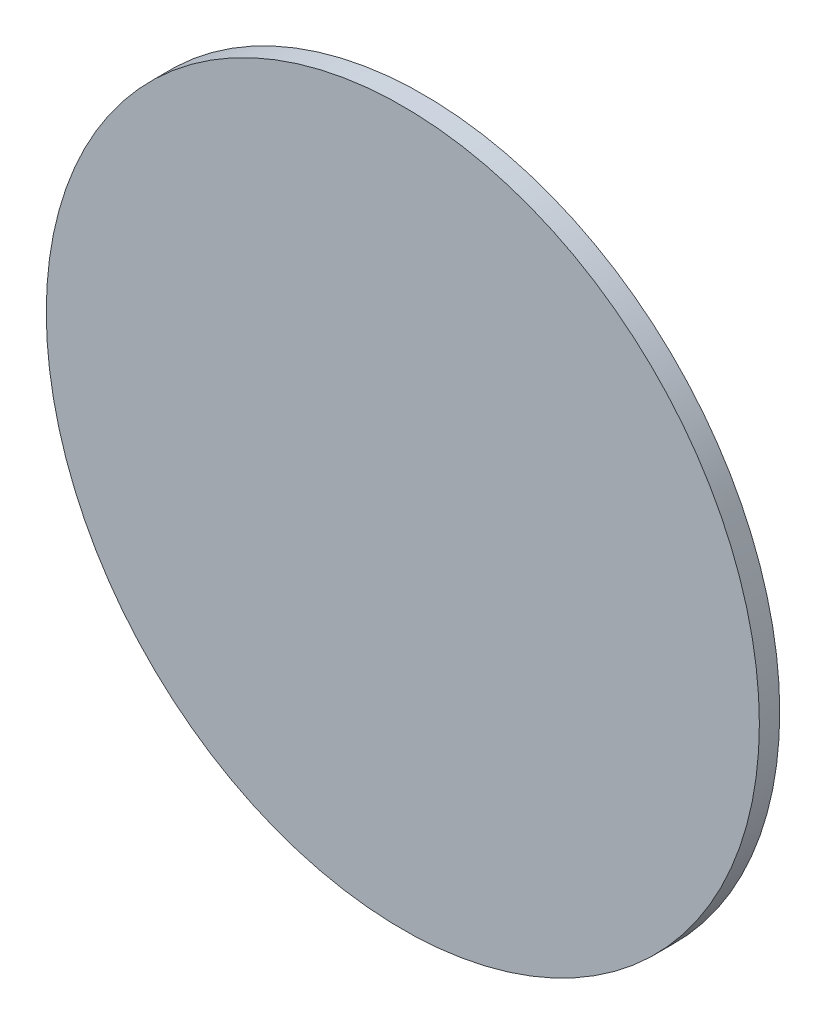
ISO-10303-21;
HEADER;
FILE_DESCRIPTION(('STEP AP214'),'2;1');
FILE_NAME('part.step','',(''),(''),'','','');
FILE_SCHEMA(('AUTOMOTIVE_DESIGN { 1 0 10303 214 1 1 1 1 }'));
ENDSEC;
DATA;
#1=APPLICATION_CONTEXT('core data for automotive mechanical design processes');
#2=APPLICATION_PROTOCOL_DEFINITION('international standard','automotive_design',2000,#1);
#3=PRODUCT_CONTEXT('',#1,'mechanical');
#4=PRODUCT('Part','Part','',(#3));
#5=PRODUCT_RELATED_PRODUCT_CATEGORY('part','',(#4));
#6=PRODUCT_DEFINITION_FORMATION('','',#4);
#7=PRODUCT_DEFINITION_CONTEXT('part definition',#1,'design');
#8=PRODUCT_DEFINITION('design','',#6,#7);
#9=PRODUCT_DEFINITION_SHAPE('','',#8);
#10=(LENGTH_UNIT() NAMED_UNIT(*) SI_UNIT(.MILLI.,.METRE.));
#11=(NAMED_UNIT(*) PLANE_ANGLE_UNIT() SI_UNIT($,.RADIAN.));
#12=(NAMED_UNIT(*) SI_UNIT($,.STERADIAN.) SOLID_ANGLE_UNIT());
#13=UNCERTAINTY_MEASURE_WITH_UNIT(LENGTH_MEASURE(1.E-05),#10,'distance_accuracy_value','');
#14=(GEOMETRIC_REPRESENTATION_CONTEXT(3) GLOBAL_UNCERTAINTY_ASSIGNED_CONTEXT((#13)) GLOBAL_UNIT_ASSIGNED_CONTEXT((#10,
#11,#12)) REPRESENTATION_CONTEXT('',''));
#15=CARTESIAN_POINT('',(0.,0.,0.));
#16=DIRECTION('',(0.,0.,1.));
#17=DIRECTION('',(1.,0.,0.));
#18=AXIS2_PLACEMENT_3D('',#15,#16,#17);
#19=CARTESIAN_POINT('',(0.,0.,1.));
#20=DIRECTION('',(0.,0.,-1.));
#21=DIRECTION('',(-1.,0.,0.));
#22=AXIS2_PLACEMENT_3D('',#19,#20,#21);
#23=CYLINDRICAL_SURFACE('',#22,17.5);
#24=CARTESIAN_POINT('',(0.,0.,1.));
#25=DIRECTION('',(0.,0.,1.));
#26=DIRECTION('',(1.,0.,0.));
#27=AXIS2_PLACEMENT_3D('',#24,#25,#26);
#28=CIRCLE('',#27,17.5);
#29=CARTESIAN_POINT('',(17.5,0.,1.));
#30=VERTEX_POINT('',#29);
#31=EDGE_CURVE('E10',#30,#30,#28,.T.);
#32=ORIENTED_EDGE('',*,*,#31,.F.);
#33=EDGE_LOOP('',(#32));
#34=FACE_BOUND('',#33,.T.);
#35=CARTESIAN_POINT('',(0.,0.,0.));
#36=DIRECTION('',(0.,0.,1.));
#37=DIRECTION('',(1.,0.,0.));
#38=AXIS2_PLACEMENT_3D('',#35,#36,#37);
#39=CIRCLE('',#38,17.5);
#40=CARTESIAN_POINT('',(17.5,0.,0.));
#41=VERTEX_POINT('',#40);
#42=EDGE_CURVE('E30',#41,#41,#39,.T.);
#43=ORIENTED_EDGE('',*,*,#42,.T.);
#44=EDGE_LOOP('',(#43));
#45=FACE_BOUND('',#44,.T.);
#46=ADVANCED_FACE('F24',(#34,#45),#23,.T.);
#47=CARTESIAN_POINT('',(0.,0.,1.));
#48=DIRECTION('',(0.,0.,1.));
#49=DIRECTION('',(1.,0.,0.));
#50=AXIS2_PLACEMENT_3D('',#47,#48,#49);
#51=PLANE('',#50);
#52=ORIENTED_EDGE('',*,*,#31,.T.);
#53=EDGE_LOOP('',(#52));
#54=FACE_BOUND('',#53,.T.);
#55=ADVANCED_FACE('F39',(#54),#51,.T.);
#56=CARTESIAN_POINT('',(0.,0.,0.));
#57=DIRECTION('',(0.,0.,1.));
#58=DIRECTION('',(1.,0.,0.));
#59=AXIS2_PLACEMENT_3D('',#56,#57,#58);
#60=PLANE('',#59);
#61=ORIENTED_EDGE('',*,*,#42,.F.);
#62=EDGE_LOOP('',(#61));
#63=FACE_BOUND('',#62,.T.);
#64=ADVANCED_FACE('F37',(#63),#60,.F.);
#65=CLOSED_SHELL('',(#46,#55,#64));
#66=MANIFOLD_SOLID_BREP('B2',#65);
#67=ADVANCED_BREP_SHAPE_REPRESENTATION('',(#18,#66),#14);
#68=SHAPE_DEFINITION_REPRESENTATION(#9,#67);
ENDSEC;
END-ISO-10303-21;
